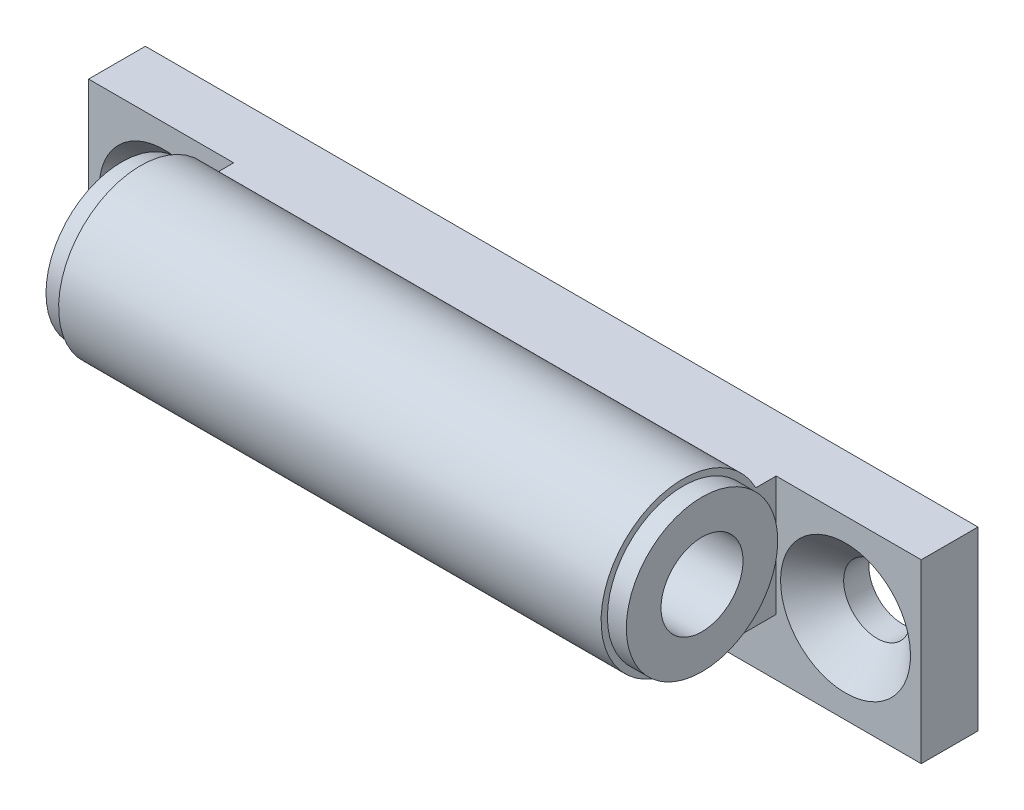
ISO-10303-21;
HEADER;
FILE_DESCRIPTION(('STEP AP214'),'2;1');
FILE_NAME('part.step','',(''),(''),'','','');
FILE_SCHEMA(('AUTOMOTIVE_DESIGN { 1 0 10303 214 1 1 1 1 }'));
ENDSEC;
DATA;
#1=APPLICATION_CONTEXT('core data for automotive mechanical design processes');
#2=APPLICATION_PROTOCOL_DEFINITION('international standard','automotive_design',2000,#1);
#3=PRODUCT_CONTEXT('',#1,'mechanical');
#4=PRODUCT('Part','Part','',(#3));
#5=PRODUCT_RELATED_PRODUCT_CATEGORY('part','',(#4));
#6=PRODUCT_DEFINITION_FORMATION('','',#4);
#7=PRODUCT_DEFINITION_CONTEXT('part definition',#1,'design');
#8=PRODUCT_DEFINITION('design','',#6,#7);
#9=PRODUCT_DEFINITION_SHAPE('','',#8);
#10=(LENGTH_UNIT() NAMED_UNIT(*) SI_UNIT(.MILLI.,.METRE.));
#11=(NAMED_UNIT(*) PLANE_ANGLE_UNIT() SI_UNIT($,.RADIAN.));
#12=(NAMED_UNIT(*) SI_UNIT($,.STERADIAN.) SOLID_ANGLE_UNIT());
#13=UNCERTAINTY_MEASURE_WITH_UNIT(LENGTH_MEASURE(1.E-05),#10,'distance_accuracy_value','');
#14=(GEOMETRIC_REPRESENTATION_CONTEXT(3) GLOBAL_UNCERTAINTY_ASSIGNED_CONTEXT((#13)) GLOBAL_UNIT_ASSIGNED_CONTEXT((#10,
#11,#12)) REPRESENTATION_CONTEXT('',''));
#15=CARTESIAN_POINT('',(0.,0.,0.));
#16=DIRECTION('',(0.,0.,1.));
#17=DIRECTION('',(1.,0.,0.));
#18=AXIS2_PLACEMENT_3D('',#15,#16,#17);
#19=CARTESIAN_POINT('',(5.5,10.5,18.3762));
#20=DIRECTION('',(-1.,0.,0.));
#21=DIRECTION('',(0.,0.,1.));
#22=AXIS2_PLACEMENT_3D('',#19,#20,#21);
#23=PLANE('',#22);
#24=DIRECTION('',(0.,-1.,0.));
#25=VECTOR('',#24,1.);
#26=CARTESIAN_POINT('',(5.5,10.5,4.5));
#27=LINE('',#26,#25);
#28=CARTESIAN_POINT('',(5.5,7.,4.5));
#29=VERTEX_POINT('',#28);
#30=CARTESIAN_POINT('',(5.5,-2.5,4.5));
#31=VERTEX_POINT('',#30);
#32=EDGE_CURVE('E81',#29,#31,#27,.T.);
#33=ORIENTED_EDGE('',*,*,#32,.T.);
#34=DIRECTION('',(0.,0.,-1.));
#35=VECTOR('',#34,1.);
#36=CARTESIAN_POINT('',(5.5,-2.5,18.3762));
#37=LINE('',#36,#35);
#38=CARTESIAN_POINT('',(5.5,-2.5,11.8762));
#39=VERTEX_POINT('',#38);
#40=EDGE_CURVE('E84',#39,#31,#37,.T.);
#41=ORIENTED_EDGE('',*,*,#40,.F.);
#42=CARTESIAN_POINT('',(5.5,4.,11.8762));
#43=DIRECTION('',(-1.,0.,0.));
#44=DIRECTION('',(0.,0.,1.));
#45=AXIS2_PLACEMENT_3D('',#42,#43,#44);
#46=CIRCLE('',#45,6.5);
#47=CARTESIAN_POINT('',(5.5,7.,6.10991870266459));
#48=VERTEX_POINT('',#47);
#49=EDGE_CURVE('E151',#39,#48,#46,.T.);
#50=ORIENTED_EDGE('',*,*,#49,.T.);
#51=DIRECTION('',(0.,0.,1.));
#52=VECTOR('',#51,1.);
#53=CARTESIAN_POINT('',(5.5,7.,6.10991870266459));
#54=LINE('',#53,#52);
#55=EDGE_CURVE('E87',#29,#48,#54,.T.);
#56=ORIENTED_EDGE('',*,*,#55,.F.);
#57=EDGE_LOOP('',(#33,#41,#50,#56));
#58=FACE_BOUND('',#57,.T.);
#59=CARTESIAN_POINT('',(5.5,4.,11.8762));
#60=DIRECTION('',(-1.,0.,0.));
#61=DIRECTION('',(0.,0.,1.));
#62=AXIS2_PLACEMENT_3D('',#59,#60,#61);
#63=CIRCLE('',#62,6.);
#64=CARTESIAN_POINT('',(5.5,4.,17.8762));
#65=VERTEX_POINT('',#64);
#66=EDGE_CURVE('E142',#65,#65,#63,.T.);
#67=ORIENTED_EDGE('',*,*,#66,.F.);
#68=EDGE_LOOP('',(#67));
#69=FACE_BOUND('',#68,.T.);
#70=ADVANCED_FACE('F14',(#58,#69),#23,.T.);
#71=CARTESIAN_POINT('',(48.5,10.5,18.3762));
#72=DIRECTION('',(-1.,0.,0.));
#73=DIRECTION('',(0.,0.,1.));
#74=AXIS2_PLACEMENT_3D('',#71,#72,#73);
#75=PLANE('',#74);
#76=DIRECTION('',(0.,0.,1.));
#77=VECTOR('',#76,1.);
#78=CARTESIAN_POINT('',(48.5,7.,6.10991870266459));
#79=LINE('',#78,#77);
#80=CARTESIAN_POINT('',(48.5,7.,4.5));
#81=VERTEX_POINT('',#80);
#82=CARTESIAN_POINT('',(48.5,7.,6.10991870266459));
#83=VERTEX_POINT('',#82);
#84=EDGE_CURVE('E161',#81,#83,#79,.T.);
#85=ORIENTED_EDGE('',*,*,#84,.T.);
#86=CARTESIAN_POINT('',(48.5,4.,11.8762));
#87=DIRECTION('',(-1.,0.,0.));
#88=DIRECTION('',(0.,0.,1.));
#89=AXIS2_PLACEMENT_3D('',#86,#87,#88);
#90=CIRCLE('',#89,6.5);
#91=CARTESIAN_POINT('',(48.5,-2.5,11.8762));
#92=VERTEX_POINT('',#91);
#93=EDGE_CURVE('E159',#92,#83,#90,.T.);
#94=ORIENTED_EDGE('',*,*,#93,.F.);
#95=DIRECTION('',(0.,0.,-1.));
#96=VECTOR('',#95,1.);
#97=CARTESIAN_POINT('',(48.5,-2.5,18.3762));
#98=LINE('',#97,#96);
#99=CARTESIAN_POINT('',(48.5,-2.5,4.5));
#100=VERTEX_POINT('',#99);
#101=EDGE_CURVE('E154',#92,#100,#98,.T.);
#102=ORIENTED_EDGE('',*,*,#101,.T.);
#103=DIRECTION('',(0.,-1.,0.));
#104=VECTOR('',#103,1.);
#105=CARTESIAN_POINT('',(48.5,10.5,4.5));
#106=LINE('',#105,#104);
#107=EDGE_CURVE('E103',#81,#100,#106,.T.);
#108=ORIENTED_EDGE('',*,*,#107,.F.);
#109=EDGE_LOOP('',(#85,#94,#102,#108));
#110=FACE_BOUND('',#109,.T.);
#111=CARTESIAN_POINT('',(48.5,4.,11.8762));
#112=DIRECTION('',(-1.,0.,0.));
#113=DIRECTION('',(0.,0.,1.));
#114=AXIS2_PLACEMENT_3D('',#111,#112,#113);
#115=CIRCLE('',#114,6.);
#116=CARTESIAN_POINT('',(48.5,4.,17.8762));
#117=VERTEX_POINT('',#116);
#118=EDGE_CURVE('E9',#117,#117,#115,.F.);
#119=ORIENTED_EDGE('',*,*,#118,.F.);
#120=EDGE_LOOP('',(#119));
#121=FACE_BOUND('',#120,.T.);
#122=ADVANCED_FACE('F193',(#110,#121),#75,.F.);
#123=CARTESIAN_POINT('',(60.,7.,6.10991870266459));
#124=DIRECTION('',(0.,1.,0.));
#125=DIRECTION('',(1.,0.,0.));
#126=AXIS2_PLACEMENT_3D('',#123,#124,#125);
#127=PLANE('',#126);
#128=DIRECTION('',(0.,0.,-1.));
#129=VECTOR('',#128,1.);
#130=CARTESIAN_POINT('',(-6.,7.,6.10991870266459));
#131=LINE('',#130,#129);
#132=CARTESIAN_POINT('',(-6.,7.,4.5));
#133=VERTEX_POINT('',#132);
#134=CARTESIAN_POINT('',(-6.,7.,0.));
#135=VERTEX_POINT('',#134);
#136=EDGE_CURVE('E170',#133,#135,#131,.T.);
#137=ORIENTED_EDGE('',*,*,#136,.F.);
#138=DIRECTION('',(1.,0.,0.));
#139=VECTOR('',#138,1.);
#140=CARTESIAN_POINT('',(60.,7.,4.5));
#141=LINE('',#140,#139);
#142=EDGE_CURVE('E90',#133,#29,#141,.T.);
#143=ORIENTED_EDGE('',*,*,#142,.T.);
#144=ORIENTED_EDGE('',*,*,#55,.T.);
#145=DIRECTION('',(-1.,0.,0.));
#146=VECTOR('',#145,1.);
#147=CARTESIAN_POINT('',(60.,7.,6.10991870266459));
#148=LINE('',#147,#146);
#149=EDGE_CURVE('E106',#83,#48,#148,.T.);
#150=ORIENTED_EDGE('',*,*,#149,.F.);
#151=ORIENTED_EDGE('',*,*,#84,.F.);
#152=DIRECTION('',(-1.,0.,0.));
#153=VECTOR('',#152,1.);
#154=CARTESIAN_POINT('',(60.,7.,4.5));
#155=LINE('',#154,#153);
#156=CARTESIAN_POINT('',(60.,7.,4.5));
#157=VERTEX_POINT('',#156);
#158=EDGE_CURVE('E157',#157,#81,#155,.T.);
#159=ORIENTED_EDGE('',*,*,#158,.F.);
#160=DIRECTION('',(0.,0.,-1.));
#161=VECTOR('',#160,1.);
#162=CARTESIAN_POINT('',(60.,7.,6.10991870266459));
#163=LINE('',#162,#161);
#164=CARTESIAN_POINT('',(60.,7.,0.));
#165=VERTEX_POINT('',#164);
#166=EDGE_CURVE('E179',#157,#165,#163,.T.);
#167=ORIENTED_EDGE('',*,*,#166,.T.);
#168=DIRECTION('',(-1.,0.,0.));
#169=VECTOR('',#168,1.);
#170=CARTESIAN_POINT('',(60.,7.,0.));
#171=LINE('',#170,#169);
#172=EDGE_CURVE('E114',#165,#135,#171,.T.);
#173=ORIENTED_EDGE('',*,*,#172,.T.);
#174=EDGE_LOOP('',(#137,#143,#144,#150,#151,#159,#167,#173));
#175=FACE_BOUND('',#174,.T.);
#176=ADVANCED_FACE('F189',(#175),#127,.T.);
#177=CARTESIAN_POINT('',(60.,4.,11.8762));
#178=DIRECTION('',(-1.,0.,0.));
#179=DIRECTION('',(0.,0.,1.));
#180=AXIS2_PLACEMENT_3D('',#177,#178,#179);
#181=CYLINDRICAL_SURFACE('',#180,6.5);
#182=ORIENTED_EDGE('',*,*,#49,.F.);
#183=DIRECTION('',(-1.,0.,0.));
#184=VECTOR('',#183,1.);
#185=CARTESIAN_POINT('',(60.,-2.5,11.8762));
#186=LINE('',#185,#184);
#187=EDGE_CURVE('E98',#92,#39,#186,.T.);
#188=ORIENTED_EDGE('',*,*,#187,.F.);
#189=ORIENTED_EDGE('',*,*,#93,.T.);
#190=ORIENTED_EDGE('',*,*,#149,.T.);
#191=EDGE_LOOP('',(#182,#188,#189,#190));
#192=FACE_BOUND('',#191,.T.);
#193=ADVANCED_FACE('F196',(#192),#181,.T.);
#194=CARTESIAN_POINT('',(60.,-2.5,11.8762));
#195=DIRECTION('',(0.,1.,0.));
#196=DIRECTION('',(0.,0.,1.));
#197=AXIS2_PLACEMENT_3D('',#194,#195,#196);
#198=PLANE('',#197);
#199=ORIENTED_EDGE('',*,*,#40,.T.);
#200=DIRECTION('',(-1.,0.,0.));
#201=VECTOR('',#200,1.);
#202=CARTESIAN_POINT('',(60.,-2.5,4.5));
#203=LINE('',#202,#201);
#204=EDGE_CURVE('E96',#100,#31,#203,.T.);
#205=ORIENTED_EDGE('',*,*,#204,.F.);
#206=ORIENTED_EDGE('',*,*,#101,.F.);
#207=ORIENTED_EDGE('',*,*,#187,.T.);
#208=EDGE_LOOP('',(#199,#205,#206,#207));
#209=FACE_BOUND('',#208,.T.);
#210=ADVANCED_FACE('F94',(#209),#198,.F.);
#211=CARTESIAN_POINT('',(-6.,4.,11.8762));
#212=DIRECTION('',(1.,0.,0.));
#213=DIRECTION('',(0.,0.,-1.));
#214=AXIS2_PLACEMENT_3D('',#211,#212,#213);
#215=PLANE('',#214);
#216=DIRECTION('',(0.,-1.,0.));
#217=VECTOR('',#216,1.);
#218=CARTESIAN_POINT('',(-6.,-2.5,4.5));
#219=LINE('',#218,#217);
#220=CARTESIAN_POINT('',(-6.,-7.,4.5));
#221=VERTEX_POINT('',#220);
#222=EDGE_CURVE('E31',#133,#221,#219,.T.);
#223=ORIENTED_EDGE('',*,*,#222,.F.);
#224=ORIENTED_EDGE('',*,*,#136,.T.);
#225=DIRECTION('',(0.,-1.,0.));
#226=VECTOR('',#225,1.);
#227=CARTESIAN_POINT('',(-6.,7.,0.));
#228=LINE('',#227,#226);
#229=CARTESIAN_POINT('',(-6.,-7.,0.));
#230=VERTEX_POINT('',#229);
#231=EDGE_CURVE('E167',#135,#230,#228,.T.);
#232=ORIENTED_EDGE('',*,*,#231,.T.);
#233=DIRECTION('',(0.,0.,-1.));
#234=VECTOR('',#233,1.);
#235=CARTESIAN_POINT('',(-6.,-7.,4.5));
#236=LINE('',#235,#234);
#237=EDGE_CURVE('E164',#221,#230,#236,.T.);
#238=ORIENTED_EDGE('',*,*,#237,.F.);
#239=EDGE_LOOP('',(#223,#224,#232,#238));
#240=FACE_BOUND('',#239,.T.);
#241=ADVANCED_FACE('F198',(#240),#215,.F.);
#242=CARTESIAN_POINT('',(60.,-7.,4.5));
#243=DIRECTION('',(0.,1.,0.));
#244=DIRECTION('',(1.,0.,0.));
#245=AXIS2_PLACEMENT_3D('',#242,#243,#244);
#246=PLANE('',#245);
#247=DIRECTION('',(-1.,0.,0.));
#248=VECTOR('',#247,1.);
#249=CARTESIAN_POINT('',(60.,-7.,0.));
#250=LINE('',#249,#248);
#251=CARTESIAN_POINT('',(60.,-7.,0.));
#252=VERTEX_POINT('',#251);
#253=EDGE_CURVE('E23',#252,#230,#250,.T.);
#254=ORIENTED_EDGE('',*,*,#253,.F.);
#255=DIRECTION('',(0.,0.,-1.));
#256=VECTOR('',#255,1.);
#257=CARTESIAN_POINT('',(60.,-7.,4.5));
#258=LINE('',#257,#256);
#259=CARTESIAN_POINT('',(60.,-7.,4.5));
#260=VERTEX_POINT('',#259);
#261=EDGE_CURVE('E173',#260,#252,#258,.T.);
#262=ORIENTED_EDGE('',*,*,#261,.F.);
#263=DIRECTION('',(-1.,0.,0.));
#264=VECTOR('',#263,1.);
#265=CARTESIAN_POINT('',(60.,-7.,4.5));
#266=LINE('',#265,#264);
#267=EDGE_CURVE('E38',#260,#221,#266,.T.);
#268=ORIENTED_EDGE('',*,*,#267,.T.);
#269=ORIENTED_EDGE('',*,*,#237,.T.);
#270=EDGE_LOOP('',(#254,#262,#268,#269));
#271=FACE_BOUND('',#270,.T.);
#272=ADVANCED_FACE('F201',(#271),#246,.F.);
#273=CARTESIAN_POINT('',(60.,7.,0.));
#274=DIRECTION('',(0.,0.,-1.));
#275=DIRECTION('',(0.,1.,0.));
#276=AXIS2_PLACEMENT_3D('',#273,#274,#275);
#277=PLANE('',#276);
#278=CARTESIAN_POINT('',(54.,0.,0.));
#279=DIRECTION('',(0.,0.,1.));
#280=DIRECTION('',(0.,-1.,0.));
#281=AXIS2_PLACEMENT_3D('',#278,#279,#280);
#282=CIRCLE('',#281,2.65);
#283=CARTESIAN_POINT('',(54.,-2.65,0.));
#284=VERTEX_POINT('',#283);
#285=EDGE_CURVE('E124',#284,#284,#282,.T.);
#286=ORIENTED_EDGE('',*,*,#285,.T.);
#287=EDGE_LOOP('',(#286));
#288=FACE_BOUND('',#287,.T.);
#289=CARTESIAN_POINT('',(0.,0.,0.));
#290=DIRECTION('',(0.,0.,1.));
#291=DIRECTION('',(0.,-1.,0.));
#292=AXIS2_PLACEMENT_3D('',#289,#290,#291);
#293=CIRCLE('',#292,2.65);
#294=CARTESIAN_POINT('',(0.,-2.65,0.));
#295=VERTEX_POINT('',#294);
#296=EDGE_CURVE('E121',#295,#295,#293,.T.);
#297=ORIENTED_EDGE('',*,*,#296,.T.);
#298=EDGE_LOOP('',(#297));
#299=FACE_BOUND('',#298,.T.);
#300=ORIENTED_EDGE('',*,*,#172,.F.);
#301=DIRECTION('',(0.,-1.,0.));
#302=VECTOR('',#301,1.);
#303=CARTESIAN_POINT('',(60.,7.,0.));
#304=LINE('',#303,#302);
#305=EDGE_CURVE('E176',#165,#252,#304,.T.);
#306=ORIENTED_EDGE('',*,*,#305,.T.);
#307=ORIENTED_EDGE('',*,*,#253,.T.);
#308=ORIENTED_EDGE('',*,*,#231,.F.);
#309=EDGE_LOOP('',(#300,#306,#307,#308));
#310=FACE_BOUND('',#309,.T.);
#311=ADVANCED_FACE('F16',(#288,#299,#310),#277,.T.);
#312=CARTESIAN_POINT('',(60.,-2.5,4.5));
#313=DIRECTION('',(0.,0.,-1.));
#314=DIRECTION('',(0.,1.,0.));
#315=AXIS2_PLACEMENT_3D('',#312,#313,#314);
#316=PLANE('',#315);
#317=CARTESIAN_POINT('',(0.,0.,4.5));
#318=DIRECTION('',(0.,0.,1.));
#319=DIRECTION('',(0.,-1.,0.));
#320=AXIS2_PLACEMENT_3D('',#317,#318,#319);
#321=CIRCLE('',#320,5.15);
#322=CARTESIAN_POINT('',(0.,-5.15,4.5));
#323=VERTEX_POINT('',#322);
#324=EDGE_CURVE('E135',#323,#323,#321,.T.);
#325=ORIENTED_EDGE('',*,*,#324,.F.);
#326=EDGE_LOOP('',(#325));
#327=FACE_BOUND('',#326,.T.);
#328=CARTESIAN_POINT('',(54.,0.,4.5));
#329=DIRECTION('',(0.,0.,1.));
#330=DIRECTION('',(0.,-1.,0.));
#331=AXIS2_PLACEMENT_3D('',#328,#329,#330);
#332=CIRCLE('',#331,5.15);
#333=CARTESIAN_POINT('',(54.,-5.15,4.5));
#334=VERTEX_POINT('',#333);
#335=EDGE_CURVE('E125',#334,#334,#332,.T.);
#336=ORIENTED_EDGE('',*,*,#335,.F.);
#337=EDGE_LOOP('',(#336));
#338=FACE_BOUND('',#337,.T.);
#339=DIRECTION('',(0.,-1.,0.));
#340=VECTOR('',#339,1.);
#341=CARTESIAN_POINT('',(60.,-2.5,4.5));
#342=LINE('',#341,#340);
#343=EDGE_CURVE('E108',#157,#260,#342,.T.);
#344=ORIENTED_EDGE('',*,*,#343,.F.);
#345=ORIENTED_EDGE('',*,*,#158,.T.);
#346=ORIENTED_EDGE('',*,*,#107,.T.);
#347=ORIENTED_EDGE('',*,*,#204,.T.);
#348=ORIENTED_EDGE('',*,*,#32,.F.);
#349=ORIENTED_EDGE('',*,*,#142,.F.);
#350=ORIENTED_EDGE('',*,*,#222,.T.);
#351=ORIENTED_EDGE('',*,*,#267,.F.);
#352=EDGE_LOOP('',(#344,#345,#346,#347,#348,#349,#350,#351));
#353=FACE_BOUND('',#352,.T.);
#354=ADVANCED_FACE('F101',(#327,#338,#353),#316,.F.);
#355=CARTESIAN_POINT('',(60.,4.,11.8762));
#356=DIRECTION('',(1.,0.,0.));
#357=DIRECTION('',(0.,0.,-1.));
#358=AXIS2_PLACEMENT_3D('',#355,#356,#357);
#359=PLANE('',#358);
#360=ORIENTED_EDGE('',*,*,#166,.F.);
#361=ORIENTED_EDGE('',*,*,#343,.T.);
#362=ORIENTED_EDGE('',*,*,#261,.T.);
#363=ORIENTED_EDGE('',*,*,#305,.F.);
#364=EDGE_LOOP('',(#360,#361,#362,#363));
#365=FACE_BOUND('',#364,.T.);
#366=ADVANCED_FACE('F183',(#365),#359,.T.);
#367=CARTESIAN_POINT('',(50.,4.,11.8762));
#368=DIRECTION('',(-1.,0.,0.));
#369=DIRECTION('',(0.,0.,1.));
#370=AXIS2_PLACEMENT_3D('',#367,#368,#369);
#371=CYLINDRICAL_SURFACE('',#370,6.);
#372=CARTESIAN_POINT('',(50.,4.,11.8762));
#373=DIRECTION('',(1.,0.,0.));
#374=DIRECTION('',(0.,0.,-1.));
#375=AXIS2_PLACEMENT_3D('',#372,#373,#374);
#376=CIRCLE('',#375,6.);
#377=CARTESIAN_POINT('',(50.,4.,5.8762));
#378=VERTEX_POINT('',#377);
#379=EDGE_CURVE('E99',#378,#378,#376,.T.);
#380=ORIENTED_EDGE('',*,*,#379,.F.);
#381=EDGE_LOOP('',(#380));
#382=FACE_BOUND('',#381,.T.);
#383=ORIENTED_EDGE('',*,*,#118,.T.);
#384=EDGE_LOOP('',(#383));
#385=FACE_BOUND('',#384,.T.);
#386=ADVANCED_FACE('F222',(#382,#385),#371,.T.);
#387=CARTESIAN_POINT('',(50.,4.,11.8762));
#388=DIRECTION('',(1.,0.,0.));
#389=DIRECTION('',(0.,0.,-1.));
#390=AXIS2_PLACEMENT_3D('',#387,#388,#389);
#391=PLANE('',#390);
#392=CARTESIAN_POINT('',(50.,4.,11.8762));
#393=DIRECTION('',(1.,0.,0.));
#394=DIRECTION('',(0.,0.,-1.));
#395=AXIS2_PLACEMENT_3D('',#392,#393,#394);
#396=CIRCLE('',#395,3.25);
#397=CARTESIAN_POINT('',(50.,4.,8.6262));
#398=VERTEX_POINT('',#397);
#399=EDGE_CURVE('E120',#398,#398,#396,.T.);
#400=ORIENTED_EDGE('',*,*,#399,.F.);
#401=EDGE_LOOP('',(#400));
#402=FACE_BOUND('',#401,.T.);
#403=ORIENTED_EDGE('',*,*,#379,.T.);
#404=EDGE_LOOP('',(#403));
#405=FACE_BOUND('',#404,.T.);
#406=ADVANCED_FACE('F230',(#402,#405),#391,.T.);
#407=CARTESIAN_POINT('',(4.,4.,11.8762));
#408=DIRECTION('',(1.,0.,0.));
#409=DIRECTION('',(0.,0.,-1.));
#410=AXIS2_PLACEMENT_3D('',#407,#408,#409);
#411=CYLINDRICAL_SURFACE('',#410,6.);
#412=CARTESIAN_POINT('',(4.,4.,11.8762));
#413=DIRECTION('',(-1.,0.,0.));
#414=DIRECTION('',(0.,0.,1.));
#415=AXIS2_PLACEMENT_3D('',#412,#413,#414);
#416=CIRCLE('',#415,6.);
#417=CARTESIAN_POINT('',(4.,4.,17.8762));
#418=VERTEX_POINT('',#417);
#419=EDGE_CURVE('E145',#418,#418,#416,.T.);
#420=ORIENTED_EDGE('',*,*,#419,.F.);
#421=EDGE_LOOP('',(#420));
#422=FACE_BOUND('',#421,.T.);
#423=ORIENTED_EDGE('',*,*,#66,.T.);
#424=EDGE_LOOP('',(#423));
#425=FACE_BOUND('',#424,.T.);
#426=ADVANCED_FACE('F241',(#422,#425),#411,.T.);
#427=CARTESIAN_POINT('',(4.,4.,11.8762));
#428=DIRECTION('',(-1.,0.,0.));
#429=DIRECTION('',(0.,0.,1.));
#430=AXIS2_PLACEMENT_3D('',#427,#428,#429);
#431=PLANE('',#430);
#432=CARTESIAN_POINT('',(4.,4.,11.8762));
#433=DIRECTION('',(-1.,0.,0.));
#434=DIRECTION('',(0.,0.,1.));
#435=AXIS2_PLACEMENT_3D('',#432,#433,#434);
#436=CIRCLE('',#435,3.25);
#437=CARTESIAN_POINT('',(4.,4.,15.1262));
#438=VERTEX_POINT('',#437);
#439=EDGE_CURVE('E118',#438,#438,#436,.T.);
#440=ORIENTED_EDGE('',*,*,#439,.F.);
#441=EDGE_LOOP('',(#440));
#442=FACE_BOUND('',#441,.T.);
#443=ORIENTED_EDGE('',*,*,#419,.T.);
#444=EDGE_LOOP('',(#443));
#445=FACE_BOUND('',#444,.T.);
#446=ADVANCED_FACE('F232',(#442,#445),#431,.T.);
#447=CARTESIAN_POINT('',(-6.,4.,11.8762));
#448=DIRECTION('',(1.,0.,0.));
#449=DIRECTION('',(0.,0.,-1.));
#450=AXIS2_PLACEMENT_3D('',#447,#448,#449);
#451=CYLINDRICAL_SURFACE('',#450,3.25);
#452=ORIENTED_EDGE('',*,*,#399,.T.);
#453=EDGE_LOOP('',(#452));
#454=FACE_BOUND('',#453,.T.);
#455=ORIENTED_EDGE('',*,*,#439,.T.);
#456=EDGE_LOOP('',(#455));
#457=FACE_BOUND('',#456,.T.);
#458=ADVANCED_FACE('F249',(#454,#457),#451,.F.);
#459=CARTESIAN_POINT('',(0.,0.,0.));
#460=DIRECTION('',(0.,0.,1.));
#461=DIRECTION('',(0.,-1.,0.));
#462=AXIS2_PLACEMENT_3D('',#459,#460,#461);
#463=CYLINDRICAL_SURFACE('',#462,2.65);
#464=CARTESIAN_POINT('',(0.,0.,2.));
#465=DIRECTION('',(0.,0.,1.));
#466=DIRECTION('',(0.,-1.,0.));
#467=AXIS2_PLACEMENT_3D('',#464,#465,#466);
#468=CIRCLE('',#467,2.65);
#469=CARTESIAN_POINT('',(0.,-2.65,2.));
#470=VERTEX_POINT('',#469);
#471=EDGE_CURVE('E18',#470,#470,#468,.T.);
#472=ORIENTED_EDGE('',*,*,#471,.T.);
#473=EDGE_LOOP('',(#472));
#474=FACE_BOUND('',#473,.T.);
#475=ORIENTED_EDGE('',*,*,#296,.F.);
#476=EDGE_LOOP('',(#475));
#477=FACE_BOUND('',#476,.T.);
#478=ADVANCED_FACE('F258',(#474,#477),#463,.F.);
#479=CARTESIAN_POINT('',(54.,0.,0.));
#480=DIRECTION('',(0.,0.,1.));
#481=DIRECTION('',(0.,-1.,0.));
#482=AXIS2_PLACEMENT_3D('',#479,#480,#481);
#483=CYLINDRICAL_SURFACE('',#482,2.65);
#484=CARTESIAN_POINT('',(54.,0.,2.));
#485=DIRECTION('',(0.,0.,1.));
#486=DIRECTION('',(0.,-1.,0.));
#487=AXIS2_PLACEMENT_3D('',#484,#485,#486);
#488=CIRCLE('',#487,2.65);
#489=CARTESIAN_POINT('',(54.,-2.65,2.));
#490=VERTEX_POINT('',#489);
#491=EDGE_CURVE('E122',#490,#490,#488,.T.);
#492=ORIENTED_EDGE('',*,*,#491,.T.);
#493=EDGE_LOOP('',(#492));
#494=FACE_BOUND('',#493,.T.);
#495=ORIENTED_EDGE('',*,*,#285,.F.);
#496=EDGE_LOOP('',(#495));
#497=FACE_BOUND('',#496,.T.);
#498=ADVANCED_FACE('F262',(#494,#497),#483,.F.);
#499=CARTESIAN_POINT('',(54.,0.,4.5));
#500=DIRECTION('',(0.,0.,1.));
#501=DIRECTION('',(0.,-1.,0.));
#502=AXIS2_PLACEMENT_3D('',#499,#500,#501);
#503=CONICAL_SURFACE('',#502,5.15,0.78539816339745);
#504=ORIENTED_EDGE('',*,*,#335,.T.);
#505=EDGE_LOOP('',(#504));
#506=FACE_BOUND('',#505,.T.);
#507=ORIENTED_EDGE('',*,*,#491,.F.);
#508=EDGE_LOOP('',(#507));
#509=FACE_BOUND('',#508,.T.);
#510=ADVANCED_FACE('F266',(#506,#509),#503,.F.);
#511=CARTESIAN_POINT('',(0.,0.,4.5));
#512=DIRECTION('',(0.,0.,1.));
#513=DIRECTION('',(0.,-1.,0.));
#514=AXIS2_PLACEMENT_3D('',#511,#512,#513);
#515=CONICAL_SURFACE('',#514,5.15,0.78539816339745);
#516=ORIENTED_EDGE('',*,*,#324,.T.);
#517=EDGE_LOOP('',(#516));
#518=FACE_BOUND('',#517,.T.);
#519=ORIENTED_EDGE('',*,*,#471,.F.);
#520=EDGE_LOOP('',(#519));
#521=FACE_BOUND('',#520,.T.);
#522=ADVANCED_FACE('F269',(#518,#521),#515,.F.);
#523=CLOSED_SHELL('',(#70,#122,#176,#193,#210,#241,#272,#311,#354,#366,#386,#406,#426,#446,#458,
#478,#498,#510,#522));
#524=MANIFOLD_SOLID_BREP('B1',#523);
#525=ADVANCED_BREP_SHAPE_REPRESENTATION('',(#18,#524),#14);
#526=SHAPE_DEFINITION_REPRESENTATION(#9,#525);
ENDSEC;
END-ISO-10303-21;
